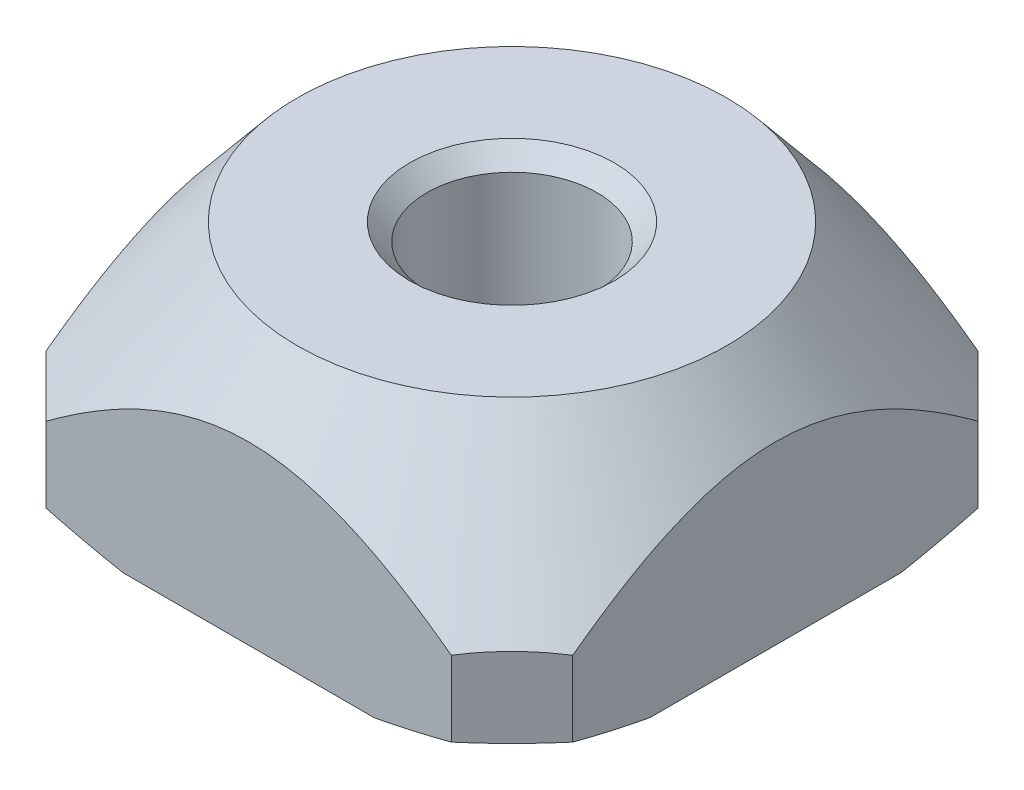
ISO-10303-21;
HEADER;
FILE_DESCRIPTION(('STEP AP214'),'2;1');
FILE_NAME('part.step','',(''),(''),'','','');
FILE_SCHEMA(('AUTOMOTIVE_DESIGN { 1 0 10303 214 1 1 1 1 }'));
ENDSEC;
DATA;
#1=APPLICATION_CONTEXT('core data for automotive mechanical design processes');
#2=APPLICATION_PROTOCOL_DEFINITION('international standard','automotive_design',2000,#1);
#3=PRODUCT_CONTEXT('',#1,'mechanical');
#4=PRODUCT('Part','Part','',(#3));
#5=PRODUCT_RELATED_PRODUCT_CATEGORY('part','',(#4));
#6=PRODUCT_DEFINITION_FORMATION('','',#4);
#7=PRODUCT_DEFINITION_CONTEXT('part definition',#1,'design');
#8=PRODUCT_DEFINITION('design','',#6,#7);
#9=PRODUCT_DEFINITION_SHAPE('','',#8);
#10=(LENGTH_UNIT() NAMED_UNIT(*) SI_UNIT(.MILLI.,.METRE.));
#11=(NAMED_UNIT(*) PLANE_ANGLE_UNIT() SI_UNIT($,.RADIAN.));
#12=(NAMED_UNIT(*) SI_UNIT($,.STERADIAN.) SOLID_ANGLE_UNIT());
#13=UNCERTAINTY_MEASURE_WITH_UNIT(LENGTH_MEASURE(1.E-05),#10,'distance_accuracy_value','');
#14=(GEOMETRIC_REPRESENTATION_CONTEXT(3) GLOBAL_UNCERTAINTY_ASSIGNED_CONTEXT((#13)) GLOBAL_UNIT_ASSIGNED_CONTEXT((#10,
#11,#12)) REPRESENTATION_CONTEXT('',''));
#15=CARTESIAN_POINT('',(0.,0.,0.));
#16=DIRECTION('',(0.,0.,1.));
#17=DIRECTION('',(1.,0.,0.));
#18=AXIS2_PLACEMENT_3D('',#15,#16,#17);
#19=CARTESIAN_POINT('',(0.,5.8,0.));
#20=DIRECTION('',(0.,-1.,0.));
#21=DIRECTION('',(0.,0.,-1.));
#22=AXIS2_PLACEMENT_3D('',#19,#20,#21);
#23=PLANE('',#22);
#24=CARTESIAN_POINT('',(0.,5.8,0.));
#25=DIRECTION('',(0.,-1.,0.));
#26=DIRECTION('',(0.,0.,-1.));
#27=AXIS2_PLACEMENT_3D('',#24,#25,#26);
#28=CIRCLE('',#27,5.3);
#29=CARTESIAN_POINT('',(0.,5.8,-5.3));
#30=VERTEX_POINT('',#29);
#31=EDGE_CURVE('E445',#30,#30,#28,.T.);
#32=ORIENTED_EDGE('',*,*,#31,.F.);
#33=EDGE_LOOP('',(#32));
#34=FACE_BOUND('',#33,.T.);
#35=CARTESIAN_POINT('',(0.,5.80000000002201,0.));
#36=DIRECTION('',(0.,1.,0.));
#37=DIRECTION('',(0.,0.,1.));
#38=AXIS2_PLACEMENT_3D('',#35,#36,#37);
#39=CIRCLE('',#38,2.52499999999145);
#40=CARTESIAN_POINT('',(0.,5.80000000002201,2.52499999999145));
#41=VERTEX_POINT('',#40);
#42=EDGE_CURVE('E19',#41,#41,#39,.F.);
#43=ORIENTED_EDGE('',*,*,#42,.T.);
#44=EDGE_LOOP('',(#43));
#45=FACE_BOUND('',#44,.T.);
#46=ADVANCED_FACE('F16',(#34,#45),#23,.F.);
#47=CARTESIAN_POINT('',(0.,5.8000000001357,0.));
#48=DIRECTION('',(0.,1.,0.));
#49=DIRECTION('',(0.,0.,1.));
#50=AXIS2_PLACEMENT_3D('',#47,#48,#49);
#51=CONICAL_SURFACE('',#50,2.52500000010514,0.785398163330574);
#52=ORIENTED_EDGE('',*,*,#42,.F.);
#53=EDGE_LOOP('',(#52));
#54=FACE_BOUND('',#53,.T.);
#55=CARTESIAN_POINT('',(0.,5.375,0.));
#56=DIRECTION('',(0.,1.,0.));
#57=DIRECTION('',(0.,0.,1.));
#58=AXIS2_PLACEMENT_3D('',#55,#56,#57);
#59=CIRCLE('',#58,2.1);
#60=CARTESIAN_POINT('',(0.,5.375,2.1));
#61=VERTEX_POINT('',#60);
#62=EDGE_CURVE('E147',#61,#61,#59,.F.);
#63=ORIENTED_EDGE('',*,*,#62,.T.);
#64=EDGE_LOOP('',(#63));
#65=FACE_BOUND('',#64,.T.);
#66=ADVANCED_FACE('F355',(#54,#65),#51,.F.);
#67=CARTESIAN_POINT('',(5.00093362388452,37.1474583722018,-6.5));
#68=DIRECTION('',(0.707106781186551,0.,-0.707106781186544));
#69=DIRECTION('',(-0.707106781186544,0.,-0.707106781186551));
#70=AXIS2_PLACEMENT_3D('',#67,#68,#69);
#71=PLANE('',#70);
#72=DIRECTION('',(0.,1.,0.));
#73=VECTOR('',#72,1.);
#74=CARTESIAN_POINT('',(5.00093362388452,5.8,-6.5));
#75=LINE('',#74,#73);
#76=CARTESIAN_POINT('',(5.00093356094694,0.429511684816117,-6.50000006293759));
#77=VERTEX_POINT('',#76);
#78=CARTESIAN_POINT('',(5.00093364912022,2.28669481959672,-6.49999997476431));
#79=VERTEX_POINT('',#78);
#80=EDGE_CURVE('E108',#77,#79,#75,.T.);
#81=ORIENTED_EDGE('',*,*,#80,.T.);
#82=CARTESIAN_POINT('',(6.50000003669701,2.28669480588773,-5.0009335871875));
#83=CARTESIAN_POINT('',(6.43784742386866,2.30045539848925,-5.06308620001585));
#84=CARTESIAN_POINT('',(6.37551621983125,2.31256643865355,-5.12541740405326));
#85=CARTESIAN_POINT('',(6.25056780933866,2.33340084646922,-5.25036581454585));
#86=CARTESIAN_POINT('',(6.18795058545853,2.34212400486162,-5.31298303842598));
#87=CARTESIAN_POINT('',(6.00058150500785,2.36298820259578,-5.50035211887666));
#88=CARTESIAN_POINT('',(5.87552418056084,2.36999999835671,-5.62540944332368));
#89=CARTESIAN_POINT('',(5.62540953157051,2.3700000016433,-5.87552409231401));
#90=CARTESIAN_POINT('',(5.5003522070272,2.36298820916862,-6.00058141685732));
#91=CARTESIAN_POINT('',(5.31298312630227,2.34212401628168,-6.18795049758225));
#92=CARTESIAN_POINT('',(5.25036590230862,2.33340085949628,-6.25056772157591));
#93=CARTESIAN_POINT('',(5.12541749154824,2.31256645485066,-6.37551613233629));
#94=CARTESIAN_POINT('',(5.06308628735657,2.30045541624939,-6.43784733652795));
#95=CARTESIAN_POINT('',(5.00093367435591,2.28669482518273,-6.49999994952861));
#96=B_SPLINE_CURVE_WITH_KNOTS('',3,(#82,#83,#84,#85,#86,#87,#88,#89,#90,#91,#92,#93,#94,#95),
.UNSPECIFIED.,.F.,.F.,(4,2,2,2,2,2,4),(0.,0.26687453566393,0.533765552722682,1.06417199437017,
1.59457843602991,1.86146945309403,2.12834398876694),.UNSPECIFIED.);
#97=CARTESIAN_POINT('',(6.5000000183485,2.28669481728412,-5.00093359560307));
#98=VERTEX_POINT('',#97);
#99=EDGE_CURVE('E101',#98,#79,#96,.T.);
#100=ORIENTED_EDGE('',*,*,#99,.F.);
#101=DIRECTION('',(0.,1.,0.));
#102=VECTOR('',#101,1.);
#103=CARTESIAN_POINT('',(6.5,5.8,-5.00093362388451));
#104=LINE('',#103,#102);
#105=CARTESIAN_POINT('',(6.50000003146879,0.429511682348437,-5.00093359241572));
#106=VERTEX_POINT('',#105);
#107=EDGE_CURVE('E106',#98,#106,#104,.F.);
#108=ORIENTED_EDGE('',*,*,#107,.T.);
#109=CARTESIAN_POINT('',(5.00093349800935,0.429511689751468,-6.50000012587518));
#110=CARTESIAN_POINT('',(5.12577543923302,0.419709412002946,-6.37515818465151));
#111=CARTESIAN_POINT('',(5.25071389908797,0.412329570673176,-6.25021972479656));
#112=CARTESIAN_POINT('',(5.50059054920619,0.402476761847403,-6.00034307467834));
#113=CARTESIAN_POINT('',(5.62552866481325,0.400000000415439,-5.87540495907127));
#114=CARTESIAN_POINT('',(5.8754048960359,0.399999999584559,-5.62552872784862));
#115=CARTESIAN_POINT('',(6.00034301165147,0.40247676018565,-5.50059061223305));
#116=CARTESIAN_POINT('',(6.25021966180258,0.412329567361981,-5.25071396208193));
#117=CARTESIAN_POINT('',(6.37515812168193,0.419709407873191,-5.12577550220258));
#118=CARTESIAN_POINT('',(6.50000006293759,0.429511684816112,-5.00093356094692));
#119=B_SPLINE_CURVE_WITH_KNOTS('',3,(#109,#110,#111,#112,#113,#114,#115,#116,#117,#118),
.UNSPECIFIED.,.F.,.F.,(4,2,2,2,4),(0.,0.530461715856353,1.06051280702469,1.59056389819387,
2.12102561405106),.UNSPECIFIED.);
#120=EDGE_CURVE('E138',#77,#106,#119,.T.);
#121=ORIENTED_EDGE('',*,*,#120,.F.);
#122=EDGE_LOOP('',(#81,#100,#108,#121));
#123=FACE_BOUND('',#122,.T.);
#124=ADVANCED_FACE('F103',(#123),#71,.T.);
#125=CARTESIAN_POINT('',(6.50000000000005,29.8974583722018,5.00093362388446));
#126=DIRECTION('',(0.707106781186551,0.,0.707106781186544));
#127=DIRECTION('',(0.707106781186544,0.,-0.707106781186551));
#128=AXIS2_PLACEMENT_3D('',#125,#126,#127);
#129=PLANE('',#128);
#130=DIRECTION('',(0.,1.,0.));
#131=VECTOR('',#130,1.);
#132=CARTESIAN_POINT('',(6.5,5.8,5.00093362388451));
#133=LINE('',#132,#131);
#134=CARTESIAN_POINT('',(6.50000006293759,0.429511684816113,5.00093356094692));
#135=VERTEX_POINT('',#134);
#136=CARTESIAN_POINT('',(6.5,2.28669481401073,5.00093362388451));
#137=VERTEX_POINT('',#136);
#138=EDGE_CURVE('E120',#135,#137,#133,.T.);
#139=ORIENTED_EDGE('',*,*,#138,.T.);
#140=CARTESIAN_POINT('',(6.5,2.28669481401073,5.00093362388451));
#141=CARTESIAN_POINT('',(6.43784738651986,2.30045540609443,5.06308623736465));
#142=CARTESIAN_POINT('',(6.37551618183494,2.31256644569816,5.12541744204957));
#143=CARTESIAN_POINT('',(6.25056777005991,2.33340085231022,5.25036585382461));
#144=CARTESIAN_POINT('',(6.18795054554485,2.34212401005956,5.31298307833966));
#145=CARTESIAN_POINT('',(6.00058146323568,2.36298820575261,5.50035216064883));
#146=CARTESIAN_POINT('',(5.87552413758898,2.37,5.62540948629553));
#147=CARTESIAN_POINT('',(5.62540948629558,2.37,5.87552413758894));
#148=CARTESIAN_POINT('',(5.50035216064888,2.36298820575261,6.00058146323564));
#149=CARTESIAN_POINT('',(5.31298307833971,2.34212401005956,6.18795054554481));
#150=CARTESIAN_POINT('',(5.25036585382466,2.33340085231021,6.25056777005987));
#151=CARTESIAN_POINT('',(5.12541744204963,2.31256644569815,6.3755161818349));
#152=CARTESIAN_POINT('',(5.0630862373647,2.30045540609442,6.43784738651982));
#153=CARTESIAN_POINT('',(5.00093362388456,2.28669481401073,6.49999999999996));
#154=B_SPLINE_CURVE_WITH_KNOTS('',3,(#140,#141,#142,#143,#144,#145,#146,#147,#148,#149,#150,
#151,#152,#153),.UNSPECIFIED.,.F.,.F.,(4,2,2,2,2,2,4),(0.,0.266874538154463,0.533765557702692,
1.06417200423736,1.59457845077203,1.86146947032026,2.12834400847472),.UNSPECIFIED.);
#155=CARTESIAN_POINT('',(5.00093362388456,2.28669481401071,6.49999999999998));
#156=VERTEX_POINT('',#155);
#157=EDGE_CURVE('E111',#137,#156,#154,.T.);
#158=ORIENTED_EDGE('',*,*,#157,.T.);
#159=DIRECTION('',(0.,1.,0.));
#160=VECTOR('',#159,1.);
#161=CARTESIAN_POINT('',(5.00093362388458,5.8,6.5));
#162=LINE('',#161,#160);
#163=CARTESIAN_POINT('',(5.00093359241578,0.429511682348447,6.50000003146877));
#164=VERTEX_POINT('',#163);
#165=EDGE_CURVE('E257',#156,#164,#162,.F.);
#166=ORIENTED_EDGE('',*,*,#165,.T.);
#167=CARTESIAN_POINT('',(6.50000012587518,0.429511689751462,5.00093349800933));
#168=CARTESIAN_POINT('',(6.37515818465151,0.419709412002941,5.125775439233));
#169=CARTESIAN_POINT('',(6.25021972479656,0.412329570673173,5.25071389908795));
#170=CARTESIAN_POINT('',(6.00034307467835,0.402476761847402,5.50059054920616));
#171=CARTESIAN_POINT('',(5.87540495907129,0.400000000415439,5.62552866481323));
#172=CARTESIAN_POINT('',(5.62552872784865,0.39999999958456,5.87540489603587));
#173=CARTESIAN_POINT('',(5.50059061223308,0.402476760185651,6.00034301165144));
#174=CARTESIAN_POINT('',(5.25071396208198,0.412329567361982,6.25021966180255));
#175=CARTESIAN_POINT('',(5.12577550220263,0.419709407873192,6.3751581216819));
#176=CARTESIAN_POINT('',(5.00093356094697,0.429511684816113,6.50000006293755));
#177=B_SPLINE_CURVE_WITH_KNOTS('',3,(#167,#168,#169,#170,#171,#172,#173,#174,#175,#176),
.UNSPECIFIED.,.F.,.F.,(4,2,2,2,4),(0.,0.530461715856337,1.06051280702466,1.59056389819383,
2.121025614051),.UNSPECIFIED.);
#178=EDGE_CURVE('E272',#135,#164,#177,.T.);
#179=ORIENTED_EDGE('',*,*,#178,.F.);
#180=EDGE_LOOP('',(#139,#158,#166,#179));
#181=FACE_BOUND('',#180,.T.);
#182=ADVANCED_FACE('F327',(#181),#129,.T.);
#183=CARTESIAN_POINT('',(0.,2.26561498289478,0.));
#184=DIRECTION('',(0.,-1.,0.));
#185=DIRECTION('',(0.,0.,-1.));
#186=AXIS2_PLACEMENT_3D('',#183,#184,#185);
#187=CONICAL_SURFACE('',#186,8.218586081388,0.690257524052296);
#188=ORIENTED_EDGE('',*,*,#31,.T.);
#189=EDGE_LOOP('',(#188));
#190=FACE_BOUND('',#189,.T.);
#191=CARTESIAN_POINT('',(-5.00093362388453,2.28669481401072,6.5));
#192=CARTESIAN_POINT('',(-5.06308623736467,2.30045540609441,6.43784738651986));
#193=CARTESIAN_POINT('',(-5.12541744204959,2.31256644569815,6.37551618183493));
#194=CARTESIAN_POINT('',(-5.25036585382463,2.33340085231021,6.2505677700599));
#195=CARTESIAN_POINT('',(-5.31298307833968,2.34212401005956,6.18795054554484));
#196=CARTESIAN_POINT('',(-5.50035216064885,2.3629882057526,6.00058146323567));
#197=CARTESIAN_POINT('',(-5.62540948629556,2.37,5.87552413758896));
#198=CARTESIAN_POINT('',(-5.87552413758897,2.37000000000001,5.62540948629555));
#199=CARTESIAN_POINT('',(-6.00058146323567,2.36298820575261,5.50035216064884));
#200=CARTESIAN_POINT('',(-6.18795054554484,2.34212401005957,5.31298307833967));
#201=CARTESIAN_POINT('',(-6.2505677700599,2.33340085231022,5.25036585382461));
#202=CARTESIAN_POINT('',(-6.37551618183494,2.31256644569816,5.12541744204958));
#203=CARTESIAN_POINT('',(-6.43784738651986,2.30045540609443,5.06308623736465));
#204=CARTESIAN_POINT('',(-6.5,2.28669481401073,5.00093362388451));
#205=B_SPLINE_CURVE_WITH_KNOTS('',3,(#191,#192,#193,#194,#195,#196,#197,#198,#199,#200,#201,
#202,#203,#204),.UNSPECIFIED.,.F.,.F.,(4,2,2,2,2,2,4),(0.,0.26687453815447,0.533765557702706,
1.06417200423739,1.59457845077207,1.8614694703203,2.12834400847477),.UNSPECIFIED.);
#206=CARTESIAN_POINT('',(-5.00093362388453,2.28669481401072,6.5));
#207=VERTEX_POINT('',#206);
#208=CARTESIAN_POINT('',(-6.5,2.28669481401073,5.00093362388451));
#209=VERTEX_POINT('',#208);
#210=EDGE_CURVE('E333',#207,#209,#205,.T.);
#211=ORIENTED_EDGE('',*,*,#210,.F.);
#212=CARTESIAN_POINT('',(-5.00093362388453,2.28669481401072,6.5));
#213=CARTESIAN_POINT('',(-4.89461882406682,2.36519488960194,6.5));
#214=CARTESIAN_POINT('',(-4.78756060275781,2.44268666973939,6.5));
#215=CARTESIAN_POINT('',(-4.57178170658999,2.59536506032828,6.5));
#216=CARTESIAN_POINT('',(-4.46306069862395,2.67055119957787,6.5));
#217=CARTESIAN_POINT('',(-4.13342181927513,2.89269870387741,6.5));
#218=CARTESIAN_POINT('',(-3.90978571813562,3.03568366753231,6.5));
#219=CARTESIAN_POINT('',(-3.4465789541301,3.31215846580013,6.5));
#220=CARTESIAN_POINT('',(-3.20672602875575,3.44517986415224,6.5));
#221=CARTESIAN_POINT('',(-2.7170779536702,3.69103259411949,6.5));
#222=CARTESIAN_POINT('',(-2.46729714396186,3.80389183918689,6.5));
#223=CARTESIAN_POINT('',(-2.03482702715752,3.97262521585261,6.5));
#224=CARTESIAN_POINT('',(-1.85483896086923,4.03539099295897,6.5));
#225=CARTESIAN_POINT('',(-1.49011877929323,4.14544511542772,6.5));
#226=CARTESIAN_POINT('',(-1.30538676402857,4.19273378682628,6.5));
#227=CARTESIAN_POINT('',(-0.934834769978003,4.26884620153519,6.5));
#228=CARTESIAN_POINT('',(-0.749067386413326,4.29792233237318,6.5));
#229=CARTESIAN_POINT('',(-0.375528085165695,4.33690000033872,6.5));
#230=CARTESIAN_POINT('',(-0.187756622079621,4.34680579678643,6.5));
#231=CARTESIAN_POINT('',(0.16789069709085,4.34681251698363,6.5));
#232=CARTESIAN_POINT('',(0.335769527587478,4.33889803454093,6.5));
#233=CARTESIAN_POINT('',(0.670076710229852,4.30766815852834,6.5));
#234=CARTESIAN_POINT('',(0.836505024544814,4.28435236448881,6.5));
#235=CARTESIAN_POINT('',(1.16887468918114,4.22305769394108,6.5));
#236=CARTESIAN_POINT('',(1.3347807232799,4.18488964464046,6.5));
#237=CARTESIAN_POINT('',(1.66300269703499,4.09557989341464,6.5));
#238=CARTESIAN_POINT('',(1.82531875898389,4.04443863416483,6.5));
#239=CARTESIAN_POINT('',(2.26283278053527,3.88965064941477,6.5));
#240=CARTESIAN_POINT('',(2.53410341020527,3.77489830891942,6.5));
#241=CARTESIAN_POINT('',(3.06513239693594,3.5205626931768,6.5));
#242=CARTESIAN_POINT('',(3.32486424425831,3.38092559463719,6.5));
#243=CARTESIAN_POINT('',(3.702501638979,3.16031756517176,6.5));
#244=CARTESIAN_POINT('',(3.82449988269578,3.08620976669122,6.5));
#245=CARTESIAN_POINT('',(4.06621203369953,2.93433161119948,6.5));
#246=CARTESIAN_POINT('',(4.18592578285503,2.85656100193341,6.5));
#247=CARTESIAN_POINT('',(4.422624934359,2.69829475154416,6.5));
#248=CARTESIAN_POINT('',(4.53962131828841,2.6178154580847,6.5));
#249=CARTESIAN_POINT('',(4.77167680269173,2.45417264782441,6.5));
#250=CARTESIAN_POINT('',(4.88673641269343,2.37100985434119,6.5));
#251=CARTESIAN_POINT('',(5.00093362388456,2.2866948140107,6.5));
#252=B_SPLINE_CURVE_WITH_KNOTS('',3,(#212,#213,#214,#215,#216,#217,#218,#219,#220,#221,#222,
#223,#224,#225,#226,#227,#228,#229,#230,#231,#232,#233,#234,#235,#236,#237,#238,#239,#240,#241,
#242,#243,#244,#245,#246,#247,#248,#249,#250,#251),.UNSPECIFIED.,.F.,.F.,(4,2,2,2,2,2,2,2,2,2,2,
2,2,2,2,2,2,2,2,4),(0.,0.396455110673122,0.792990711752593,1.58889552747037,2.41103939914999,
3.23203608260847,3.80332089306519,4.37459366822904,4.93776368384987,5.50080855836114,
6.00427946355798,6.50776346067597,7.01788207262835,7.52798328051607,8.40977024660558,
9.29348810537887,9.72166656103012,10.1498745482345,10.5758468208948,11.0017052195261),.UNSPECIFIED.);
#253=EDGE_CURVE('E258',#207,#156,#252,.T.);
#254=ORIENTED_EDGE('',*,*,#253,.T.);
#255=ORIENTED_EDGE('',*,*,#157,.F.);
#256=CARTESIAN_POINT('',(6.5,2.28669481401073,5.00093362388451));
#257=CARTESIAN_POINT('',(6.5,2.36546542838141,4.89425230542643));
#258=CARTESIAN_POINT('',(6.5,2.44322075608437,4.78682264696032));
#259=CARTESIAN_POINT('',(6.5,2.59640967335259,4.57028828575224));
#260=CARTESIAN_POINT('',(6.5,2.67184277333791,4.46118323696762));
#261=CARTESIAN_POINT('',(6.5,2.89472597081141,4.13033374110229));
#262=CARTESIAN_POINT('',(6.5,3.03816727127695,3.90584895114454));
#263=CARTESIAN_POINT('',(6.5,3.31446263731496,3.44248350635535));
#264=CARTESIAN_POINT('',(6.5,3.44694761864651,3.20338079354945));
#265=CARTESIAN_POINT('',(6.5,3.69182258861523,2.71532773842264));
#266=CARTESIAN_POINT('',(6.5,3.80424366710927,2.46639337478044));
#267=CARTESIAN_POINT('',(6.5,3.96403148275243,2.05685433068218));
#268=CARTESIAN_POINT('',(6.5,4.01970687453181,1.89949160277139));
#269=CARTESIAN_POINT('',(6.5,4.11943260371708,1.58107070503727));
#270=CARTESIAN_POINT('',(6.5,4.16348252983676,1.42001240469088));
#271=CARTESIAN_POINT('',(6.5,4.23795252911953,1.09621460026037));
#272=CARTESIAN_POINT('',(6.5,4.26848771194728,0.93350186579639));
#273=CARTESIAN_POINT('',(6.5,4.31512465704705,0.606006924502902));
#274=CARTESIAN_POINT('',(6.5,4.33122767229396,0.441224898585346));
#275=CARTESIAN_POINT('',(6.5,4.34827314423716,0.109455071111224));
#276=CARTESIAN_POINT('',(6.5,4.34908501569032,-0.0575395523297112));
#277=CARTESIAN_POINT('',(6.5,4.33517110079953,-0.390873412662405));
#278=CARTESIAN_POINT('',(6.5,4.32044494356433,-0.557212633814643));
#279=CARTESIAN_POINT('',(6.5,4.2761251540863,-0.88848991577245));
#280=CARTESIAN_POINT('',(6.5,4.24647760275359,-1.05342067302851));
#281=CARTESIAN_POINT('',(6.5,4.17365597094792,-1.3802445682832));
#282=CARTESIAN_POINT('',(6.5,4.13047995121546,-1.54213726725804));
#283=CARTESIAN_POINT('',(6.5,4.00941900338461,-1.93674499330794));
#284=CARTESIAN_POINT('',(6.5,3.92473121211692,-2.16737187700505));
#285=CARTESIAN_POINT('',(6.5,3.73524387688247,-2.62020320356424));
#286=CARTESIAN_POINT('',(6.5,3.6304297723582,-2.84240140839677));
#287=CARTESIAN_POINT('',(6.5,3.40508735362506,-3.27921361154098));
#288=CARTESIAN_POINT('',(6.5,3.2845244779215,-3.49380956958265));
#289=CARTESIAN_POINT('',(6.5,3.03152298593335,-3.91571764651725));
#290=CARTESIAN_POINT('',(6.5,2.89908838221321,-4.12303219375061));
#291=CARTESIAN_POINT('',(6.5,2.68529870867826,-4.44159950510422));
#292=CARTESIAN_POINT('',(6.5,2.60709917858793,-4.55499497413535));
#293=CARTESIAN_POINT('',(6.5,2.44851798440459,-4.77950010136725));
#294=CARTESIAN_POINT('',(6.5,2.36814750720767,-4.89061765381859));
#295=CARTESIAN_POINT('',(6.5,2.28669482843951,-5.00093360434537));
#296=B_SPLINE_CURVE_WITH_KNOTS('',3,(#256,#257,#258,#259,#260,#261,#262,#263,#264,#265,#266,
#267,#268,#269,#270,#271,#272,#273,#274,#275,#276,#277,#278,#279,#280,#281,#282,#283,#284,#285,
#286,#287,#288,#289,#290,#291,#292,#293,#294,#295),.UNSPECIFIED.,.F.,.F.,(4,2,2,2,2,2,2,2,2,2,2,
2,2,2,2,2,2,2,2,4),(0.,0.39782125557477,0.795725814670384,1.59450470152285,2.41391220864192,
3.23203877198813,3.7324336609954,4.23284625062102,4.72891053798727,5.22493175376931,
5.72518705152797,6.22545429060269,6.727542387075,7.2297024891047,7.96546321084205,
8.70175824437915,9.43969714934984,10.1773875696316,10.590593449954,11.0019709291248),.UNSPECIFIED.);
#297=EDGE_CURVE('E113',#137,#98,#296,.T.);
#298=ORIENTED_EDGE('',*,*,#297,.T.);
#299=ORIENTED_EDGE('',*,*,#99,.T.);
#300=CARTESIAN_POINT('',(5.00093365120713,2.28669479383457,-6.5));
#301=CARTESIAN_POINT('',(4.89461885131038,2.36519486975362,-6.5));
#302=CARTESIAN_POINT('',(4.78756062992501,2.442686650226,-6.5));
#303=CARTESIAN_POINT('',(4.57178173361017,2.59536504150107,-6.5));
#304=CARTESIAN_POINT('',(4.46306072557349,2.67055118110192,-6.5));
#305=CARTESIAN_POINT('',(4.13342184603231,2.89269868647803,-6.5));
#306=CARTESIAN_POINT('',(3.90978574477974,3.03568365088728,-6.5));
#307=CARTESIAN_POINT('',(3.44657898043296,3.31215845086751,-6.5));
#308=CARTESIAN_POINT('',(3.20672605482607,3.44517985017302,-6.5));
#309=CARTESIAN_POINT('',(2.71707797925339,3.69103258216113,-6.5));
#310=CARTESIAN_POINT('',(2.46729716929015,3.80389182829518,-6.5));
#311=CARTESIAN_POINT('',(2.03482705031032,3.97262520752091,-6.5));
#312=CARTESIAN_POINT('',(1.85483898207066,4.0353909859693,-6.5));
#313=CARTESIAN_POINT('',(1.49011879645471,4.1454451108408,-6.5));
#314=CARTESIAN_POINT('',(1.30538677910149,4.19273378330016,-6.5));
#315=CARTESIAN_POINT('',(0.934834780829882,4.26884619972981,-6.5));
#316=CARTESIAN_POINT('',(0.749067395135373,4.29792233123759,-6.5));
#317=CARTESIAN_POINT('',(0.37552808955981,4.33690000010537,-6.5));
#318=CARTESIAN_POINT('',(0.18775662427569,4.34680579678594,-6.5));
#319=CARTESIAN_POINT('',(-0.167890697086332,4.34681251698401,-6.5));
#320=CARTESIAN_POINT('',(-0.335769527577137,4.33889803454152,-6.5));
#321=CARTESIAN_POINT('',(-0.67007671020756,4.30766815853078,-6.5));
#322=CARTESIAN_POINT('',(-0.836505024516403,4.28435236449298,-6.5));
#323=CARTESIAN_POINT('',(-1.16887468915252,4.22305769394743,-6.5));
#324=CARTESIAN_POINT('',(-1.33478072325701,4.1848896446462,-6.5));
#325=CARTESIAN_POINT('',(-1.66300269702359,4.09557989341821,-6.5));
#326=CARTESIAN_POINT('',(-1.82531875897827,4.04443863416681,-6.5));
#327=CARTESIAN_POINT('',(-2.26283278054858,3.88965064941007,-6.5));
#328=CARTESIAN_POINT('',(-2.53410341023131,3.77489830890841,-6.5));
#329=CARTESIAN_POINT('',(-3.06513239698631,3.52056269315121,-6.5));
#330=CARTESIAN_POINT('',(-3.32486424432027,3.38092559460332,-6.5));
#331=CARTESIAN_POINT('',(-3.7025016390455,3.16031756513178,-6.5));
#332=CARTESIAN_POINT('',(-3.82449988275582,3.08620976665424,-6.5));
#333=CARTESIAN_POINT('',(-4.0662120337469,2.93433161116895,-6.5));
#334=CARTESIAN_POINT('',(-4.18592578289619,2.85656100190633,-6.5));
#335=CARTESIAN_POINT('',(-4.422624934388,2.69829475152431,-6.5));
#336=CARTESIAN_POINT('',(-4.53962131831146,2.61781545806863,-6.5));
#337=CARTESIAN_POINT('',(-4.77167680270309,2.45417264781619,-6.5));
#338=CARTESIAN_POINT('',(-4.88673641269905,2.37100985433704,-6.5));
#339=CARTESIAN_POINT('',(-5.00093362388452,2.28669481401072,-6.5));
#340=B_SPLINE_CURVE_WITH_KNOTS('',3,(#300,#301,#302,#303,#304,#305,#306,#307,#308,#309,#310,
#311,#312,#313,#314,#315,#316,#317,#318,#319,#320,#321,#322,#323,#324,#325,#326,#327,#328,#329,
#330,#331,#332,#333,#334,#335,#336,#337,#338,#339),.UNSPECIFIED.,.F.,.F.,(4,2,2,2,2,2,2,2,2,2,2,
2,2,2,2,2,2,2,2,4),(0.,0.396455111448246,0.792990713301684,1.5888955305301,2.41103940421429,
3.23203608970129,3.80332090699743,4.37459368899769,4.93776371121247,5.50080859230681,
6.00427949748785,6.50776349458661,7.01788210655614,7.52798331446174,8.40977028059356,
9.29348813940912,9.72166659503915,10.1498745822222,10.5758468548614,11.0017052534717),.UNSPECIFIED.);
#341=CARTESIAN_POINT('',(-5.00093362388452,2.28669481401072,-6.5));
#342=VERTEX_POINT('',#341);
#343=EDGE_CURVE('E144',#79,#342,#340,.T.);
#344=ORIENTED_EDGE('',*,*,#343,.T.);
#345=CARTESIAN_POINT('',(-6.5,2.28669481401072,-5.00093362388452));
#346=CARTESIAN_POINT('',(-6.43784738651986,2.30045540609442,-5.06308623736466));
#347=CARTESIAN_POINT('',(-6.37551618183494,2.31256644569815,-5.12541744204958));
#348=CARTESIAN_POINT('',(-6.2505677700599,2.33340085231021,-5.25036585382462));
#349=CARTESIAN_POINT('',(-6.18795054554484,2.34212401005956,-5.31298307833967));
#350=CARTESIAN_POINT('',(-6.00058146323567,2.36298820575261,-5.50035216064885));
#351=CARTESIAN_POINT('',(-5.87552413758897,2.37,-5.62540948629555));
#352=CARTESIAN_POINT('',(-5.62540948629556,2.37000000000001,-5.87552413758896));
#353=CARTESIAN_POINT('',(-5.50035216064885,2.36298820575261,-6.00058146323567));
#354=CARTESIAN_POINT('',(-5.31298307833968,2.34212401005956,-6.18795054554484));
#355=CARTESIAN_POINT('',(-5.25036585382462,2.33340085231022,-6.2505677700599));
#356=CARTESIAN_POINT('',(-5.12541744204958,2.31256644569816,-6.37551618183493));
#357=CARTESIAN_POINT('',(-5.06308623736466,2.30045540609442,-6.43784738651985));
#358=CARTESIAN_POINT('',(-5.00093362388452,2.28669481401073,-6.5));
#359=B_SPLINE_CURVE_WITH_KNOTS('',3,(#345,#346,#347,#348,#349,#350,#351,#352,#353,#354,#355,
#356,#357,#358),.UNSPECIFIED.,.F.,.F.,(4,2,2,2,2,2,4),(0.,0.26687453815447,0.533765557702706,
1.06417200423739,1.59457845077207,1.8614694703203,2.12834400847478),.UNSPECIFIED.);
#360=CARTESIAN_POINT('',(-6.5,2.28669481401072,-5.00093362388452));
#361=VERTEX_POINT('',#360);
#362=EDGE_CURVE('E150',#361,#342,#359,.T.);
#363=ORIENTED_EDGE('',*,*,#362,.F.);
#364=CARTESIAN_POINT('',(-6.5,2.28669481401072,-5.00093362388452));
#365=CARTESIAN_POINT('',(-6.5,2.36546542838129,-4.89425230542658));
#366=CARTESIAN_POINT('',(-6.5,2.44322075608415,-4.78682264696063));
#367=CARTESIAN_POINT('',(-6.5,2.59640967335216,-4.57028828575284));
#368=CARTESIAN_POINT('',(-6.5,2.67184277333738,-4.46118323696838));
#369=CARTESIAN_POINT('',(-6.5,2.89472597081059,-4.13033374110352));
#370=CARTESIAN_POINT('',(-6.5,3.03816727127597,-3.90584895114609));
#371=CARTESIAN_POINT('',(-6.5,3.31446263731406,-3.44248350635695));
#372=CARTESIAN_POINT('',(-6.5,3.44694761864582,-3.20338079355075));
#373=CARTESIAN_POINT('',(-6.5,3.69182258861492,-2.71532773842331));
#374=CARTESIAN_POINT('',(-6.5,3.80424366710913,-2.46639337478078));
#375=CARTESIAN_POINT('',(-6.5,3.96403148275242,-2.05685433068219));
#376=CARTESIAN_POINT('',(-6.5,4.0197068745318,-1.89949160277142));
#377=CARTESIAN_POINT('',(-6.5,4.11943260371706,-1.58107070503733));
#378=CARTESIAN_POINT('',(-6.5,4.16348252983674,-1.42001240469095));
#379=CARTESIAN_POINT('',(-6.5,4.23795252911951,-1.09621460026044));
#380=CARTESIAN_POINT('',(-6.5,4.26848771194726,-0.933501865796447));
#381=CARTESIAN_POINT('',(-6.5,4.31512465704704,-0.606006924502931));
#382=CARTESIAN_POINT('',(-6.5,4.33122767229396,-0.441224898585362));
#383=CARTESIAN_POINT('',(-6.5,4.34827314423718,-0.109455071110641));
#384=CARTESIAN_POINT('',(-6.5,4.34908501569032,0.0575395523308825));
#385=CARTESIAN_POINT('',(-6.5,4.33517110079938,0.390873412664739));
#386=CARTESIAN_POINT('',(-6.5,4.32044494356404,0.557212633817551));
#387=CARTESIAN_POINT('',(-6.5,4.2761251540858,0.888489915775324));
#388=CARTESIAN_POINT('',(-6.5,4.24647760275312,1.05342067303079));
#389=CARTESIAN_POINT('',(-6.5,4.17365597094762,1.38024456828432));
#390=CARTESIAN_POINT('',(-6.5,4.13047995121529,1.5421372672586));
#391=CARTESIAN_POINT('',(-6.5,4.00941900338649,1.93674499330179));
#392=CARTESIAN_POINT('',(-6.5,3.92473121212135,2.16737187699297));
#393=CARTESIAN_POINT('',(-6.5,3.73524387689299,2.62020320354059));
#394=CARTESIAN_POINT('',(-6.5,3.63042977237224,2.8424014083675));
#395=CARTESIAN_POINT('',(-6.5,3.40508735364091,3.2792136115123));
#396=CARTESIAN_POINT('',(-6.5,3.2845244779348,3.49380956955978));
#397=CARTESIAN_POINT('',(-6.5,3.03152298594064,3.91571764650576));
#398=CARTESIAN_POINT('',(-6.5,2.89908838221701,4.1230321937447));
#399=CARTESIAN_POINT('',(-6.5,2.68529870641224,4.44159950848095));
#400=CARTESIAN_POINT('',(-6.5,2.6070991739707,4.55499498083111));
#401=CARTESIAN_POINT('',(-6.5,2.44851797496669,4.77950011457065));
#402=CARTESIAN_POINT('',(-6.5,2.36814749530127,4.89061767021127));
#403=CARTESIAN_POINT('',(-6.5,2.28669481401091,5.00093362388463));
#404=B_SPLINE_CURVE_WITH_KNOTS('',3,(#364,#365,#366,#367,#368,#369,#370,#371,#372,#373,#374,
#375,#376,#377,#378,#379,#380,#381,#382,#383,#384,#385,#386,#387,#388,#389,#390,#391,#392,#393,
#394,#395,#396,#397,#398,#399,#400,#401,#402,#403),.UNSPECIFIED.,.F.,.F.,(4,2,2,2,2,2,2,2,2,2,2,
2,2,2,2,2,2,2,2,4),(0.,0.397821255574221,0.795725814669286,1.59450470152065,2.41391220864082,
3.23203877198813,3.73243366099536,4.23284625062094,4.72891053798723,5.22493175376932,
5.72518705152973,6.2254542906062,6.72754238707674,7.22970248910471,7.96546321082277,
8.70175824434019,9.43969714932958,10.1773875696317,10.5905934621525,11.0019709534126),.UNSPECIFIED.);
#405=EDGE_CURVE('E218',#361,#209,#404,.T.);
#406=ORIENTED_EDGE('',*,*,#405,.T.);
#407=EDGE_LOOP('',(#211,#254,#255,#298,#299,#344,#363,#406));
#408=FACE_BOUND('',#407,.T.);
#409=ADVANCED_FACE('F115',(#190,#408),#187,.T.);
#410=CARTESIAN_POINT('',(-5.00093362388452,29.8974583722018,6.5));
#411=DIRECTION('',(-0.707106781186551,0.,0.707106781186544));
#412=DIRECTION('',(0.707106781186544,0.,0.707106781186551));
#413=AXIS2_PLACEMENT_3D('',#410,#411,#412);
#414=PLANE('',#413);
#415=DIRECTION('',(0.,1.,0.));
#416=VECTOR('',#415,1.);
#417=CARTESIAN_POINT('',(-5.00093362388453,5.8,6.5));
#418=LINE('',#417,#416);
#419=CARTESIAN_POINT('',(-5.00093356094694,0.429511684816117,6.50000006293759));
#420=VERTEX_POINT('',#419);
#421=EDGE_CURVE('E134',#420,#207,#418,.T.);
#422=ORIENTED_EDGE('',*,*,#421,.T.);
#423=ORIENTED_EDGE('',*,*,#210,.T.);
#424=DIRECTION('',(0.,1.,0.));
#425=VECTOR('',#424,1.);
#426=CARTESIAN_POINT('',(-6.5,5.8,5.00093362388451));
#427=LINE('',#426,#425);
#428=CARTESIAN_POINT('',(-6.49999996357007,0.429511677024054,5.00093366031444));
#429=VERTEX_POINT('',#428);
#430=EDGE_CURVE('E217',#209,#429,#427,.F.);
#431=ORIENTED_EDGE('',*,*,#430,.T.);
#432=CARTESIAN_POINT('',(-5.00093349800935,0.429511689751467,6.50000012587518));
#433=CARTESIAN_POINT('',(-5.12577542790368,0.419709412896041,6.37515819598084));
#434=CARTESIAN_POINT('',(-5.25071387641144,0.412329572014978,6.25021974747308));
#435=CARTESIAN_POINT('',(-5.50059050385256,0.402476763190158,6.00034312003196));
#436=CARTESIAN_POINT('',(-5.62552860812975,0.400000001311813,5.87540501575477));
#437=CARTESIAN_POINT('',(-5.87540481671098,0.399999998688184,5.62552880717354));
#438=CARTESIAN_POINT('',(-6.00034292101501,0.402476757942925,5.5005907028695));
#439=CARTESIAN_POINT('',(-6.25021954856,0.412329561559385,5.25071407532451));
#440=CARTESIAN_POINT('',(-6.37515799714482,0.419709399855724,5.12577562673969));
#441=CARTESIAN_POINT('',(-6.49999992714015,0.429511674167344,5.00093369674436));
#442=B_SPLINE_CURVE_WITH_KNOTS('',3,(#432,#433,#434,#435,#436,#437,#438,#439,#440,#441),
.UNSPECIFIED.,.F.,.F.,(4,2,2,2,4),(0.,0.530461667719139,1.0605127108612,1.5905637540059,
2.12102542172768),.UNSPECIFIED.);
#443=EDGE_CURVE('E235',#420,#429,#442,.T.);
#444=ORIENTED_EDGE('',*,*,#443,.F.);
#445=EDGE_LOOP('',(#422,#423,#431,#444));
#446=FACE_BOUND('',#445,.T.);
#447=ADVANCED_FACE('F326',(#446),#414,.T.);
#448=CARTESIAN_POINT('',(-6.50000000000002,29.8974583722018,-5.0009336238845));
#449=DIRECTION('',(-0.707106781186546,0.,-0.707106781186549));
#450=DIRECTION('',(-0.707106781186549,0.,0.707106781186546));
#451=AXIS2_PLACEMENT_3D('',#448,#449,#450);
#452=PLANE('',#451);
#453=DIRECTION('',(0.,1.,0.));
#454=VECTOR('',#453,1.);
#455=CARTESIAN_POINT('',(-6.5,5.8,-5.00093362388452));
#456=LINE('',#455,#454);
#457=CARTESIAN_POINT('',(-6.50000006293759,0.429511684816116,-5.00093356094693));
#458=VERTEX_POINT('',#457);
#459=EDGE_CURVE('E395',#458,#361,#456,.T.);
#460=ORIENTED_EDGE('',*,*,#459,.T.);
#461=ORIENTED_EDGE('',*,*,#362,.T.);
#462=DIRECTION('',(0.,1.,0.));
#463=VECTOR('',#462,1.);
#464=CARTESIAN_POINT('',(-5.00093362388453,5.8,-6.5));
#465=LINE('',#464,#463);
#466=CARTESIAN_POINT('',(-5.00093369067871,0.42951169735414,-6.5));
#467=VERTEX_POINT('',#466);
#468=EDGE_CURVE('E139',#342,#467,#465,.F.);
#469=ORIENTED_EDGE('',*,*,#468,.T.);
#470=CARTESIAN_POINT('',(-6.50000012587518,0.429511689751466,-5.00093349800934));
#471=CARTESIAN_POINT('',(-6.37515819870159,0.419709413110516,-5.12577542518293));
#472=CARTESIAN_POINT('',(-6.25021975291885,0.41232957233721,-5.25071387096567));
#473=CARTESIAN_POINT('',(-6.00034313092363,0.40247676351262,-5.50059049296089));
#474=CARTESIAN_POINT('',(-5.87540502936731,0.400000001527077,-5.62552859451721));
#475=CARTESIAN_POINT('',(-5.62552882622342,0.399999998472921,-5.8754047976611));
#476=CARTESIAN_POINT('',(-5.50059072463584,0.402476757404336,-6.00034289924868));
#477=CARTESIAN_POINT('',(-5.2507141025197,0.412329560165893,-6.25021952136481));
#478=CARTESIAN_POINT('',(-5.12577565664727,0.41970939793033,-6.37515796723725));
#479=CARTESIAN_POINT('',(-5.00093372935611,0.429511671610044,-6.49999989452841));
#480=B_SPLINE_CURVE_WITH_KNOTS('',3,(#470,#471,#472,#473,#474,#475,#476,#477,#478,#479),
.UNSPECIFIED.,.F.,.F.,(4,2,2,2,4),(0.,0.530461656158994,1.06051268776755,1.59056371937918,
2.12102537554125),.UNSPECIFIED.);
#481=EDGE_CURVE('E181',#458,#467,#480,.T.);
#482=ORIENTED_EDGE('',*,*,#481,.F.);
#483=EDGE_LOOP('',(#460,#461,#469,#482));
#484=FACE_BOUND('',#483,.T.);
#485=ADVANCED_FACE('F376',(#484),#452,.T.);
#486=CARTESIAN_POINT('',(0.,5.8,0.));
#487=DIRECTION('',(0.,1.,0.));
#488=DIRECTION('',(0.,0.,1.));
#489=AXIS2_PLACEMENT_3D('',#486,#487,#488);
#490=CYLINDRICAL_SURFACE('',#489,2.1);
#491=ORIENTED_EDGE('',*,*,#62,.F.);
#492=EDGE_LOOP('',(#491));
#493=FACE_BOUND('',#492,.T.);
#494=CARTESIAN_POINT('',(0.,0.,0.));
#495=DIRECTION('',(0.,1.,0.));
#496=DIRECTION('',(0.,0.,1.));
#497=AXIS2_PLACEMENT_3D('',#494,#495,#496);
#498=CIRCLE('',#497,2.1);
#499=CARTESIAN_POINT('',(0.,0.,2.1));
#500=VERTEX_POINT('',#499);
#501=EDGE_CURVE('E167',#500,#500,#498,.T.);
#502=ORIENTED_EDGE('',*,*,#501,.F.);
#503=EDGE_LOOP('',(#502));
#504=FACE_BOUND('',#503,.T.);
#505=ADVANCED_FACE('F374',(#493,#504),#490,.F.);
#506=CARTESIAN_POINT('',(-6.5,5.8,-6.5));
#507=DIRECTION('',(0.,0.,1.));
#508=DIRECTION('',(1.,0.,0.));
#509=AXIS2_PLACEMENT_3D('',#506,#507,#508);
#510=PLANE('',#509);
#511=ORIENTED_EDGE('',*,*,#468,.F.);
#512=ORIENTED_EDGE('',*,*,#343,.F.);
#513=ORIENTED_EDGE('',*,*,#80,.F.);
#514=CARTESIAN_POINT('',(3.0967725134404,0.,-6.5));
#515=CARTESIAN_POINT('',(3.25681087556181,0.0295324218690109,-6.5));
#516=CARTESIAN_POINT('',(3.41650959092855,0.0608632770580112,-6.5));
#517=CARTESIAN_POINT('',(3.73518371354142,0.126759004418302,-6.5));
#518=CARTESIAN_POINT('',(3.89415934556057,0.161322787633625,-6.5));
#519=CARTESIAN_POINT('',(4.21144082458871,0.233339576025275,-6.5));
#520=CARTESIAN_POINT('',(4.36974671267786,0.270792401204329,-6.5));
#521=CARTESIAN_POINT('',(4.68578021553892,0.3482890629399,-6.5));
#522=CARTESIAN_POINT('',(4.84350761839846,0.388333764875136,-6.5));
#523=CARTESIAN_POINT('',(5.00093343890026,0.429511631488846,-6.5));
#524=B_SPLINE_CURVE_WITH_KNOTS('',3,(#514,#515,#516,#517,#518,#519,#520,#521,#522,#523),
.UNSPECIFIED.,.F.,.F.,(4,2,2,2,4),(0.,0.488199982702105,0.97623611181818,1.46424185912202,
1.95241139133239),.UNSPECIFIED.);
#525=CARTESIAN_POINT('',(3.0967725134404,0.,-6.5));
#526=VERTEX_POINT('',#525);
#527=EDGE_CURVE('E143',#526,#77,#524,.T.);
#528=ORIENTED_EDGE('',*,*,#527,.F.);
#529=DIRECTION('',(1.,0.,0.));
#530=VECTOR('',#529,1.);
#531=CARTESIAN_POINT('',(0.,0.,-6.5));
#532=LINE('',#531,#530);
#533=CARTESIAN_POINT('',(-3.0967725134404,0.,-6.5));
#534=VERTEX_POINT('',#533);
#535=EDGE_CURVE('E166',#534,#526,#532,.T.);
#536=ORIENTED_EDGE('',*,*,#535,.F.);
#537=CARTESIAN_POINT('',(-5.00093375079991,0.429511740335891,-6.49999996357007));
#538=CARTESIAN_POINT('',(-4.84350790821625,0.388333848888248,-6.4999999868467));
#539=CARTESIAN_POINT('',(-4.68578048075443,0.348289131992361,-6.49999999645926));
#540=CARTESIAN_POINT('',(-4.36974692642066,0.270792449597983,-6.50000000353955));
#541=CARTESIAN_POINT('',(-4.21144101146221,0.233339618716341,-6.50000000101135));
#542=CARTESIAN_POINT('',(-3.89415947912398,0.16132281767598,-6.49999999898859));
#543=CARTESIAN_POINT('',(-3.73518382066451,0.126759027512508,-6.49999999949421));
#544=CARTESIAN_POINT('',(-3.41650964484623,0.0608632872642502,-6.50000000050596));
#545=CARTESIAN_POINT('',(-3.25681090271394,0.0295324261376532,-6.5000000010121));
#546=CARTESIAN_POINT('',(-3.0967725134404,0.,-6.5));
#547=B_SPLINE_CURVE_WITH_KNOTS('',3,(#537,#538,#539,#540,#541,#542,#543,#544,#545,#546),
.UNSPECIFIED.,.F.,.F.,(4,2,2,2,4),(0.,0.488169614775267,0.976175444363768,1.46421165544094,
1.95241172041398),.UNSPECIFIED.);
#548=EDGE_CURVE('E171',#467,#534,#547,.T.);
#549=ORIENTED_EDGE('',*,*,#548,.F.);
#550=EDGE_LOOP('',(#511,#512,#513,#528,#536,#549));
#551=FACE_BOUND('',#550,.T.);
#552=ADVANCED_FACE('F188',(#551),#510,.F.);
#553=CARTESIAN_POINT('',(0.,0.432088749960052,0.));
#554=DIRECTION('',(0.,1.,0.));
#555=DIRECTION('',(0.,0.,1.));
#556=AXIS2_PLACEMENT_3D('',#553,#554,#555);
#557=CONICAL_SURFACE('',#556,8.207186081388,1.1655375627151);
#558=ORIENTED_EDGE('',*,*,#527,.T.);
#559=ORIENTED_EDGE('',*,*,#120,.T.);
#560=CARTESIAN_POINT('',(6.50000003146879,0.429511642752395,-5.0009335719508));
#561=CARTESIAN_POINT('',(6.50000001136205,0.388333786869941,-4.84350773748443));
#562=CARTESIAN_POINT('',(6.50000000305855,0.348289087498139,-4.68578032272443));
#563=CARTESIAN_POINT('',(6.49999999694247,0.27079242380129,-4.36974679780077));
#564=CARTESIAN_POINT('',(6.49999999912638,0.233339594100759,-4.21144089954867));
#565=CARTESIAN_POINT('',(6.50000000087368,0.161322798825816,-3.89415939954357));
#566=CARTESIAN_POINT('',(6.50000000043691,0.126759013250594,-3.73518375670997));
#567=CARTESIAN_POINT('',(6.49999999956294,0.0608632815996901,-3.4165096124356));
#568=CARTESIAN_POINT('',(6.49999999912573,0.0295324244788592,-3.25681088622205));
#569=CARTESIAN_POINT('',(6.5,0.,-3.0967725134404));
#570=B_SPLINE_CURVE_WITH_KNOTS('',3,(#560,#561,#562,#563,#564,#565,#566,#567,#568,#569),
.UNSPECIFIED.,.F.,.F.,(4,2,2,2,4),(0.,0.488169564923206,0.976175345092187,1.46421150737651,
1.95241152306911),.UNSPECIFIED.);
#571=CARTESIAN_POINT('',(6.5,0.,-3.09677251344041));
#572=VERTEX_POINT('',#571);
#573=EDGE_CURVE('E125',#106,#572,#570,.T.);
#574=ORIENTED_EDGE('',*,*,#573,.T.);
#575=CARTESIAN_POINT('',(0.,0.,0.));
#576=DIRECTION('',(0.,1.,0.));
#577=DIRECTION('',(0.,0.,1.));
#578=AXIS2_PLACEMENT_3D('',#575,#576,#577);
#579=CIRCLE('',#578,7.2);
#580=EDGE_CURVE('E162',#526,#572,#579,.F.);
#581=ORIENTED_EDGE('',*,*,#580,.F.);
#582=EDGE_LOOP('',(#558,#559,#574,#581));
#583=FACE_BOUND('',#582,.T.);
#584=ADVANCED_FACE('F294',(#583),#557,.T.);
#585=CARTESIAN_POINT('',(6.5,5.8,6.5));
#586=DIRECTION('',(-1.,0.,0.));
#587=DIRECTION('',(0.,0.,1.));
#588=AXIS2_PLACEMENT_3D('',#585,#586,#587);
#589=PLANE('',#588);
#590=ORIENTED_EDGE('',*,*,#107,.F.);
#591=ORIENTED_EDGE('',*,*,#297,.F.);
#592=ORIENTED_EDGE('',*,*,#138,.F.);
#593=CARTESIAN_POINT('',(6.5,0.,3.09677251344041));
#594=CARTESIAN_POINT('',(6.5,0.0295324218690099,3.25681087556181));
#595=CARTESIAN_POINT('',(6.5,0.06086327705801,3.41650959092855));
#596=CARTESIAN_POINT('',(6.5,0.1267590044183,3.73518371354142));
#597=CARTESIAN_POINT('',(6.5,0.161322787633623,3.89415934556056));
#598=CARTESIAN_POINT('',(6.5,0.233339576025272,4.2114408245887));
#599=CARTESIAN_POINT('',(6.5,0.270792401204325,4.36974671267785));
#600=CARTESIAN_POINT('',(6.5,0.348289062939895,4.68578021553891));
#601=CARTESIAN_POINT('',(6.5,0.388333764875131,4.84350761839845));
#602=CARTESIAN_POINT('',(6.5,0.429511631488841,5.00093343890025));
#603=B_SPLINE_CURVE_WITH_KNOTS('',3,(#593,#594,#595,#596,#597,#598,#599,#600,#601,#602),
.UNSPECIFIED.,.F.,.F.,(4,2,2,2,4),(0.,0.488199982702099,0.976236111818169,1.46424185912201,
1.95241139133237),.UNSPECIFIED.);
#604=CARTESIAN_POINT('',(6.5,0.,3.09677251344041));
#605=VERTEX_POINT('',#604);
#606=EDGE_CURVE('E130',#605,#135,#603,.T.);
#607=ORIENTED_EDGE('',*,*,#606,.F.);
#608=DIRECTION('',(0.,0.,-1.));
#609=VECTOR('',#608,1.);
#610=CARTESIAN_POINT('',(6.5,0.,0.));
#611=LINE('',#610,#609);
#612=EDGE_CURVE('E161',#572,#605,#611,.F.);
#613=ORIENTED_EDGE('',*,*,#612,.F.);
#614=ORIENTED_EDGE('',*,*,#573,.F.);
#615=EDGE_LOOP('',(#590,#591,#592,#607,#613,#614));
#616=FACE_BOUND('',#615,.T.);
#617=ADVANCED_FACE('F123',(#616),#589,.F.);
#618=CARTESIAN_POINT('',(0.,0.432088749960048,0.));
#619=DIRECTION('',(0.,1.,0.));
#620=DIRECTION('',(0.,0.,1.));
#621=AXIS2_PLACEMENT_3D('',#618,#619,#620);
#622=CONICAL_SURFACE('',#621,8.20718608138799,1.1655375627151);
#623=ORIENTED_EDGE('',*,*,#606,.T.);
#624=ORIENTED_EDGE('',*,*,#178,.T.);
#625=CARTESIAN_POINT('',(5.00093356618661,0.429511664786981,6.5));
#626=CARTESIAN_POINT('',(4.84350773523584,0.388333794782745,6.5));
#627=CARTESIAN_POINT('',(4.68578032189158,0.348289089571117,6.5));
#628=CARTESIAN_POINT('',(4.36974679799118,0.270792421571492,6.5));
#629=CARTESIAN_POINT('',(4.21144089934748,0.233339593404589,6.5));
#630=CARTESIAN_POINT('',(3.89415939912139,0.161322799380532,6.5));
#631=CARTESIAN_POINT('',(3.73518375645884,0.126759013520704,6.5));
#632=CARTESIAN_POINT('',(3.41650961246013,0.0608632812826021,6.5));
#633=CARTESIAN_POINT('',(3.25681088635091,0.02953242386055,6.5));
#634=CARTESIAN_POINT('',(3.09677251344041,0.,6.5));
#635=B_SPLINE_CURVE_WITH_KNOTS('',3,(#625,#626,#627,#628,#629,#630,#631,#632,#633,#634),
.UNSPECIFIED.,.F.,.F.,(4,2,2,2,4),(0.,0.488169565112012,0.97617534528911,1.46421150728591,
1.95241152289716),.UNSPECIFIED.);
#636=CARTESIAN_POINT('',(3.09677251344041,0.,6.5));
#637=VERTEX_POINT('',#636);
#638=EDGE_CURVE('E250',#164,#637,#635,.T.);
#639=ORIENTED_EDGE('',*,*,#638,.T.);
#640=CARTESIAN_POINT('',(0.,0.,0.));
#641=DIRECTION('',(0.,1.,0.));
#642=DIRECTION('',(0.,0.,1.));
#643=AXIS2_PLACEMENT_3D('',#640,#641,#642);
#644=CIRCLE('',#643,7.2);
#645=EDGE_CURVE('E157',#605,#637,#644,.F.);
#646=ORIENTED_EDGE('',*,*,#645,.F.);
#647=EDGE_LOOP('',(#623,#624,#639,#646));
#648=FACE_BOUND('',#647,.T.);
#649=ADVANCED_FACE('F264',(#648),#622,.T.);
#650=CARTESIAN_POINT('',(-6.5,5.8,6.5));
#651=DIRECTION('',(0.,0.,-1.));
#652=DIRECTION('',(-1.,0.,0.));
#653=AXIS2_PLACEMENT_3D('',#650,#651,#652);
#654=PLANE('',#653);
#655=ORIENTED_EDGE('',*,*,#165,.F.);
#656=ORIENTED_EDGE('',*,*,#253,.F.);
#657=ORIENTED_EDGE('',*,*,#421,.F.);
#658=CARTESIAN_POINT('',(-3.09677251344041,0.,6.5));
#659=CARTESIAN_POINT('',(-3.25681087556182,0.0295324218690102,6.5));
#660=CARTESIAN_POINT('',(-3.41650959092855,0.0608632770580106,6.5));
#661=CARTESIAN_POINT('',(-3.73518371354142,0.126759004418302,6.5));
#662=CARTESIAN_POINT('',(-3.89415934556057,0.161322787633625,6.5));
#663=CARTESIAN_POINT('',(-4.21144082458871,0.233339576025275,6.5));
#664=CARTESIAN_POINT('',(-4.36974671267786,0.270792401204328,6.5));
#665=CARTESIAN_POINT('',(-4.68578021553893,0.348289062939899,6.5));
#666=CARTESIAN_POINT('',(-4.84350761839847,0.388333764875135,6.5));
#667=CARTESIAN_POINT('',(-5.00093343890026,0.429511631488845,6.5));
#668=B_SPLINE_CURVE_WITH_KNOTS('',3,(#658,#659,#660,#661,#662,#663,#664,#665,#666,#667),
.UNSPECIFIED.,.F.,.F.,(4,2,2,2,4),(0.,0.488199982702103,0.976236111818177,1.46424185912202,
1.95241139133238),.UNSPECIFIED.);
#669=CARTESIAN_POINT('',(-3.09677251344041,0.,6.5));
#670=VERTEX_POINT('',#669);
#671=EDGE_CURVE('E242',#670,#420,#668,.T.);
#672=ORIENTED_EDGE('',*,*,#671,.F.);
#673=DIRECTION('',(1.,0.,0.));
#674=VECTOR('',#673,1.);
#675=CARTESIAN_POINT('',(0.,0.,6.5));
#676=LINE('',#675,#674);
#677=EDGE_CURVE('E156',#637,#670,#676,.F.);
#678=ORIENTED_EDGE('',*,*,#677,.F.);
#679=ORIENTED_EDGE('',*,*,#638,.F.);
#680=EDGE_LOOP('',(#655,#656,#657,#672,#678,#679));
#681=FACE_BOUND('',#680,.T.);
#682=ADVANCED_FACE('F229',(#681),#654,.F.);
#683=CARTESIAN_POINT('',(0.,0.432088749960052,0.));
#684=DIRECTION('',(0.,1.,0.));
#685=DIRECTION('',(-1.,0.,0.));
#686=AXIS2_PLACEMENT_3D('',#683,#684,#685);
#687=CONICAL_SURFACE('',#686,8.207186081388,1.1655375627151);
#688=CARTESIAN_POINT('',(-6.5,0.429511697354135,5.0009336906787));
#689=CARTESIAN_POINT('',(-6.5,0.388333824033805,4.84350784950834));
#690=CARTESIAN_POINT('',(-6.5,0.348289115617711,4.68578042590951));
#691=CARTESIAN_POINT('',(-6.5,0.270792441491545,4.36974688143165));
#692=CARTESIAN_POINT('',(-6.5,0.233339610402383,4.21144097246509));
#693=CARTESIAN_POINT('',(-6.5,0.161322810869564,3.89415945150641));
#694=CARTESIAN_POINT('',(-6.5,0.126759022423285,3.73518379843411));
#695=CARTESIAN_POINT('',(-6.5,0.0608632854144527,3.41650963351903));
#696=CARTESIAN_POINT('',(-6.5,0.0295324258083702,3.25681089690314));
#697=CARTESIAN_POINT('',(-6.5,0.,3.0967725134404));
#698=B_SPLINE_CURVE_WITH_KNOTS('',3,(#688,#689,#690,#691,#692,#693,#694,#695,#696,#697),
.UNSPECIFIED.,.F.,.F.,(4,2,2,2,4),(0.,0.48816959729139,0.976175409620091,1.4642116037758,
1.95241165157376),.UNSPECIFIED.);
#699=CARTESIAN_POINT('',(-6.5,0.,3.0967725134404));
#700=VERTEX_POINT('',#699);
#701=EDGE_CURVE('E210',#429,#700,#698,.T.);
#702=ORIENTED_EDGE('',*,*,#701,.T.);
#703=CARTESIAN_POINT('',(0.,0.,0.));
#704=DIRECTION('',(0.,1.,0.));
#705=DIRECTION('',(-1.,0.,0.));
#706=AXIS2_PLACEMENT_3D('',#703,#704,#705);
#707=CIRCLE('',#706,7.2);
#708=EDGE_CURVE('E152',#670,#700,#707,.F.);
#709=ORIENTED_EDGE('',*,*,#708,.F.);
#710=ORIENTED_EDGE('',*,*,#671,.T.);
#711=ORIENTED_EDGE('',*,*,#443,.T.);
#712=EDGE_LOOP('',(#702,#709,#710,#711));
#713=FACE_BOUND('',#712,.T.);
#714=ADVANCED_FACE('F225',(#713),#687,.T.);
#715=CARTESIAN_POINT('',(-6.5,5.8,6.5));
#716=DIRECTION('',(1.,0.,0.));
#717=DIRECTION('',(0.,0.,-1.));
#718=AXIS2_PLACEMENT_3D('',#715,#716,#717);
#719=PLANE('',#718);
#720=ORIENTED_EDGE('',*,*,#430,.F.);
#721=ORIENTED_EDGE('',*,*,#405,.F.);
#722=ORIENTED_EDGE('',*,*,#459,.F.);
#723=CARTESIAN_POINT('',(-6.5,0.,-3.0967725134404));
#724=CARTESIAN_POINT('',(-6.5,0.0295324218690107,-3.25681087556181));
#725=CARTESIAN_POINT('',(-6.5,0.0608632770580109,-3.41650959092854));
#726=CARTESIAN_POINT('',(-6.5,0.126759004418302,-3.73518371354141));
#727=CARTESIAN_POINT('',(-6.5,0.161322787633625,-3.89415934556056));
#728=CARTESIAN_POINT('',(-6.5,0.233339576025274,-4.2114408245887));
#729=CARTESIAN_POINT('',(-6.5,0.270792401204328,-4.36974671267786));
#730=CARTESIAN_POINT('',(-6.5,0.348289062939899,-4.68578021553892));
#731=CARTESIAN_POINT('',(-6.5,0.388333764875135,-4.84350761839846));
#732=CARTESIAN_POINT('',(-6.5,0.429511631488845,-5.00093343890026));
#733=B_SPLINE_CURVE_WITH_KNOTS('',3,(#723,#724,#725,#726,#727,#728,#729,#730,#731,#732),
.UNSPECIFIED.,.F.,.F.,(4,2,2,2,4),(0.,0.488199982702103,0.976236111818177,1.46424185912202,
1.95241139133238),.UNSPECIFIED.);
#734=CARTESIAN_POINT('',(-6.5,0.,-3.0967725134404));
#735=VERTEX_POINT('',#734);
#736=EDGE_CURVE('E35',#735,#458,#733,.T.);
#737=ORIENTED_EDGE('',*,*,#736,.F.);
#738=DIRECTION('',(0.,0.,-1.));
#739=VECTOR('',#738,1.);
#740=CARTESIAN_POINT('',(-6.5,0.,0.));
#741=LINE('',#740,#739);
#742=EDGE_CURVE('E26',#700,#735,#741,.T.);
#743=ORIENTED_EDGE('',*,*,#742,.F.);
#744=ORIENTED_EDGE('',*,*,#701,.F.);
#745=EDGE_LOOP('',(#720,#721,#722,#737,#743,#744));
#746=FACE_BOUND('',#745,.T.);
#747=ADVANCED_FACE('F198',(#746),#719,.F.);
#748=CARTESIAN_POINT('',(0.,0.432088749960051,0.));
#749=DIRECTION('',(0.,1.,0.));
#750=DIRECTION('',(0.,0.,1.));
#751=AXIS2_PLACEMENT_3D('',#748,#749,#750);
#752=CONICAL_SURFACE('',#751,8.207186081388,1.1655375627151);
#753=ORIENTED_EDGE('',*,*,#548,.T.);
#754=CARTESIAN_POINT('',(0.,0.,0.));
#755=DIRECTION('',(0.,1.,0.));
#756=DIRECTION('',(0.,0.,1.));
#757=AXIS2_PLACEMENT_3D('',#754,#755,#756);
#758=CIRCLE('',#757,7.2);
#759=EDGE_CURVE('E10',#735,#534,#758,.F.);
#760=ORIENTED_EDGE('',*,*,#759,.F.);
#761=ORIENTED_EDGE('',*,*,#736,.T.);
#762=ORIENTED_EDGE('',*,*,#481,.T.);
#763=EDGE_LOOP('',(#753,#760,#761,#762));
#764=FACE_BOUND('',#763,.T.);
#765=ADVANCED_FACE('F192',(#764),#752,.T.);
#766=CARTESIAN_POINT('',(0.,0.,0.));
#767=DIRECTION('',(0.,-1.,0.));
#768=DIRECTION('',(0.,0.,-1.));
#769=AXIS2_PLACEMENT_3D('',#766,#767,#768);
#770=PLANE('',#769);
#771=ORIENTED_EDGE('',*,*,#742,.T.);
#772=ORIENTED_EDGE('',*,*,#759,.T.);
#773=ORIENTED_EDGE('',*,*,#535,.T.);
#774=ORIENTED_EDGE('',*,*,#580,.T.);
#775=ORIENTED_EDGE('',*,*,#612,.T.);
#776=ORIENTED_EDGE('',*,*,#645,.T.);
#777=ORIENTED_EDGE('',*,*,#677,.T.);
#778=ORIENTED_EDGE('',*,*,#708,.T.);
#779=EDGE_LOOP('',(#771,#772,#773,#774,#775,#776,#777,#778));
#780=FACE_BOUND('',#779,.T.);
#781=ORIENTED_EDGE('',*,*,#501,.T.);
#782=EDGE_LOOP('',(#781));
#783=FACE_BOUND('',#782,.T.);
#784=ADVANCED_FACE('F197',(#780,#783),#770,.T.);
#785=CLOSED_SHELL('',(#46,#66,#124,#182,#409,#447,#485,#505,#552,#584,#617,#649,#682,#714,#747,
#765,#784));
#786=MANIFOLD_SOLID_BREP('B1',#785);
#787=ADVANCED_BREP_SHAPE_REPRESENTATION('',(#18,#786),#14);
#788=SHAPE_DEFINITION_REPRESENTATION(#9,#787);
ENDSEC;
END-ISO-10303-21;
